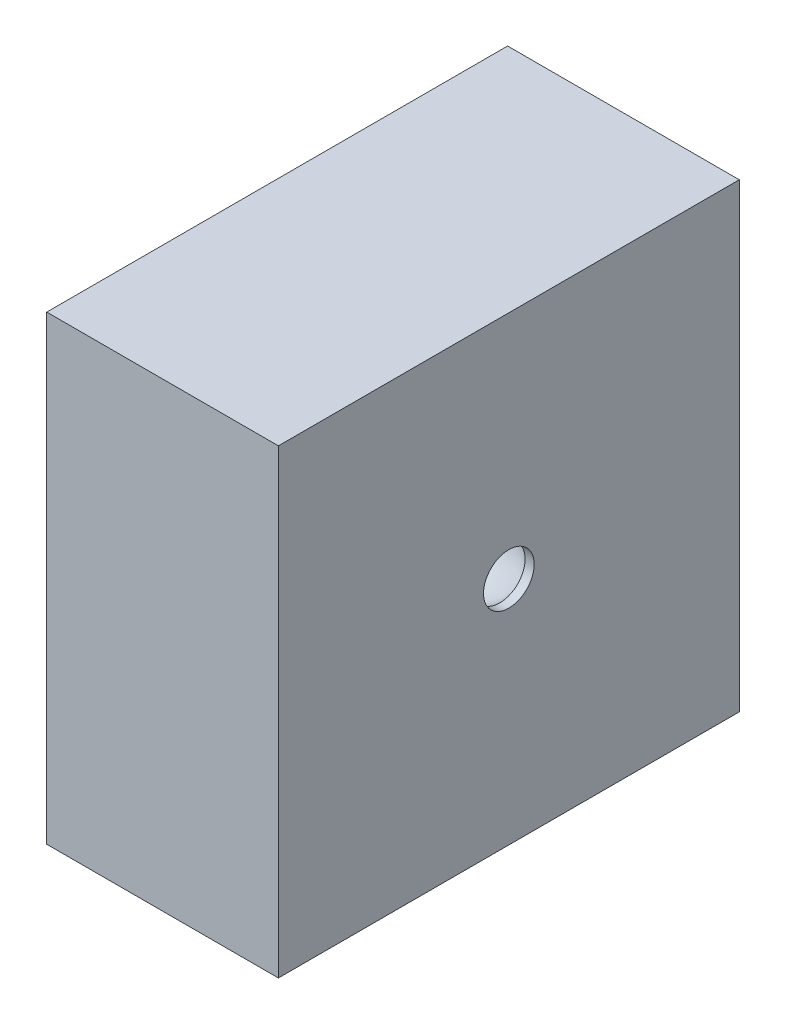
from build123d import *

# Parameters (mm, degrees)
SKETCH2_W           = 50.8
SKETCH2_H           = 50.8
SKETCH2_R           = 5.560124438
BOSS_EXTRUDE1_DEPTH = 6.486412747
BOSS_EXTRUDE2_START = 19.05
SKETCH5_W           = 50.8
SKETCH5_H           = 50.8
SKETCH5_R           = 6.580701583
BOSS_EXTRUDE2_DEPTH = 19.05


with BuildPart() as part:
    # Sketch1 → Revolve1 (revolve)
    with BuildSketch(Plane(origin=(0, 0, 0), x_dir=(1, 0, 0), z_dir=(0, 1, 0))):
        with BuildLine():
            Line((1.2251e-05, 5.560124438), (1.2251e-05, 2.794))
            Line((1.2251e-05, 2.794), (-1.000000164, 2.794))
            ThreePointArc((-1.000000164, 2.794), (-3.600911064, 4.138129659), (-6.486400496, 4.633480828))
            Line((-6.486400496, 4.633480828), (-6.486400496, 5.560124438))
            Line((-6.486400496, 5.560124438), (1.2251e-05, 5.560124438))
        make_face()
    revolve(axis=Axis((0, 0, 0), (-1, 0, 0)))

    # Sketch2 → Boss-Extrude1 (add)
    with BuildSketch(Plane(origin=(1.2251e-05, 0, 0), x_dir=(0, 0, -1), z_dir=(1, 0, 0))):
        Rectangle(SKETCH2_W, SKETCH2_H)
        Circle(SKETCH2_R, mode=Mode.SUBTRACT)
    extrude(amount=-BOSS_EXTRUDE1_DEPTH)

    # Sketch3 → Revolve2 (revolve)
    with BuildSketch(Plane.XY, mode=Mode.PRIVATE) as revolve2_sk:
        Polygon((-25.536400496, 4.892675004), (-6.486400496, 4.633480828), (-6.486400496, 6.580701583), (-25.536400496, 6.580701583), align=None)
    revolve(revolve2_sk.sketch.rotate(Axis((-6.486400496, 0, 0), (-1, 0, 0)), 90), axis=Axis((-6.486400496, 0, 0), (-1, 0, 0)))

    # Sketch5 → Boss-Extrude2 (add)
    with BuildSketch(Plane.ZY.offset(6.486400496).offset(BOSS_EXTRUDE2_START)):
        Rectangle(SKETCH5_W, SKETCH5_H)
        Circle(SKETCH5_R, mode=Mode.SUBTRACT)
    extrude(amount=-BOSS_EXTRUDE2_DEPTH)


solid = part.part
